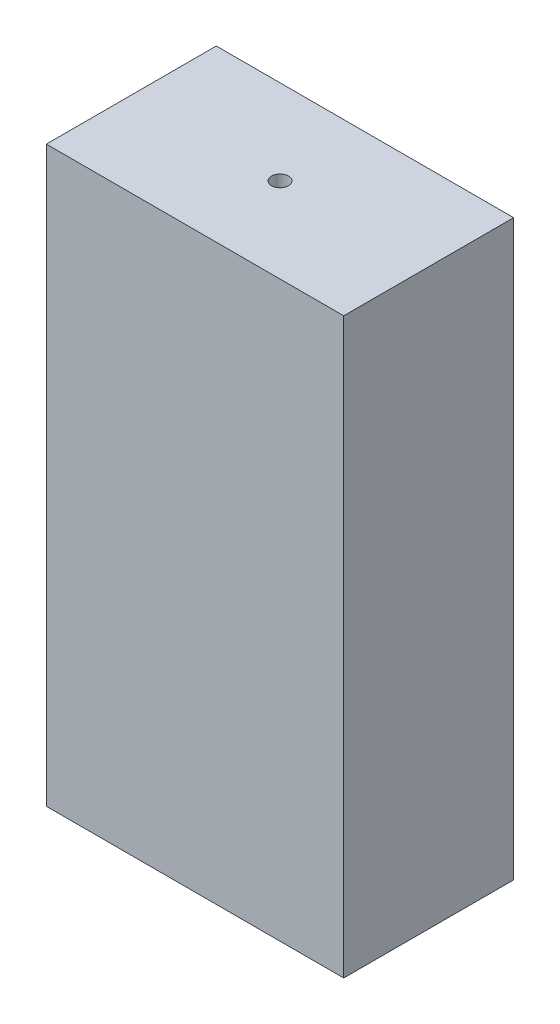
ISO-10303-21;
HEADER;
FILE_DESCRIPTION(('STEP AP214'),'2;1');
FILE_NAME('part.step','',(''),(''),'','','');
FILE_SCHEMA(('AUTOMOTIVE_DESIGN { 1 0 10303 214 1 1 1 1 }'));
ENDSEC;
DATA;
#1=APPLICATION_CONTEXT('core data for automotive mechanical design processes');
#2=APPLICATION_PROTOCOL_DEFINITION('international standard','automotive_design',2000,#1);
#3=PRODUCT_CONTEXT('',#1,'mechanical');
#4=PRODUCT('Part','Part','',(#3));
#5=PRODUCT_RELATED_PRODUCT_CATEGORY('part','',(#4));
#6=PRODUCT_DEFINITION_FORMATION('','',#4);
#7=PRODUCT_DEFINITION_CONTEXT('part definition',#1,'design');
#8=PRODUCT_DEFINITION('design','',#6,#7);
#9=PRODUCT_DEFINITION_SHAPE('','',#8);
#10=(LENGTH_UNIT() NAMED_UNIT(*) SI_UNIT(.MILLI.,.METRE.));
#11=(NAMED_UNIT(*) PLANE_ANGLE_UNIT() SI_UNIT($,.RADIAN.));
#12=(NAMED_UNIT(*) SI_UNIT($,.STERADIAN.) SOLID_ANGLE_UNIT());
#13=UNCERTAINTY_MEASURE_WITH_UNIT(LENGTH_MEASURE(1.E-05),#10,'distance_accuracy_value','');
#14=(GEOMETRIC_REPRESENTATION_CONTEXT(3) GLOBAL_UNCERTAINTY_ASSIGNED_CONTEXT((#13)) GLOBAL_UNIT_ASSIGNED_CONTEXT((#10,
#11,#12)) REPRESENTATION_CONTEXT('',''));
#15=CARTESIAN_POINT('',(0.,0.,0.));
#16=DIRECTION('',(0.,0.,1.));
#17=DIRECTION('',(1.,0.,0.));
#18=AXIS2_PLACEMENT_3D('',#15,#16,#17);
#19=CARTESIAN_POINT('',(44.45,171.45,-25.4));
#20=DIRECTION('',(-1.,0.,0.));
#21=DIRECTION('',(0.,0.,1.));
#22=AXIS2_PLACEMENT_3D('',#19,#20,#21);
#23=PLANE('',#22);
#24=DIRECTION('',(0.,0.,-1.));
#25=VECTOR('',#24,1.);
#26=CARTESIAN_POINT('',(44.45,0.,-25.4));
#27=LINE('',#26,#25);
#28=CARTESIAN_POINT('',(44.45,0.,25.4));
#29=VERTEX_POINT('',#28);
#30=CARTESIAN_POINT('',(44.45,0.,-25.4));
#31=VERTEX_POINT('',#30);
#32=EDGE_CURVE('E93',#29,#31,#27,.T.);
#33=ORIENTED_EDGE('',*,*,#32,.T.);
#34=DIRECTION('',(0.,-1.,0.));
#35=VECTOR('',#34,1.);
#36=CARTESIAN_POINT('',(44.45,171.45,-25.4));
#37=LINE('',#36,#35);
#38=CARTESIAN_POINT('',(44.45,171.45,-25.4));
#39=VERTEX_POINT('',#38);
#40=EDGE_CURVE('E11',#39,#31,#37,.T.);
#41=ORIENTED_EDGE('',*,*,#40,.F.);
#42=DIRECTION('',(0.,0.,-1.));
#43=VECTOR('',#42,1.);
#44=CARTESIAN_POINT('',(44.45,171.45,-25.4));
#45=LINE('',#44,#43);
#46=CARTESIAN_POINT('',(44.45,171.45,25.4));
#47=VERTEX_POINT('',#46);
#48=EDGE_CURVE('E102',#47,#39,#45,.T.);
#49=ORIENTED_EDGE('',*,*,#48,.F.);
#50=DIRECTION('',(0.,-1.,0.));
#51=VECTOR('',#50,1.);
#52=CARTESIAN_POINT('',(44.45,171.45,25.4));
#53=LINE('',#52,#51);
#54=EDGE_CURVE('E107',#47,#29,#53,.T.);
#55=ORIENTED_EDGE('',*,*,#54,.T.);
#56=EDGE_LOOP('',(#33,#41,#49,#55));
#57=FACE_BOUND('',#56,.T.);
#58=ADVANCED_FACE('F32',(#57),#23,.F.);
#59=CARTESIAN_POINT('',(-44.45,171.45,-25.4));
#60=DIRECTION('',(0.,0.,1.));
#61=DIRECTION('',(1.,0.,0.));
#62=AXIS2_PLACEMENT_3D('',#59,#60,#61);
#63=PLANE('',#62);
#64=DIRECTION('',(-1.,0.,0.));
#65=VECTOR('',#64,1.);
#66=CARTESIAN_POINT('',(-44.45,0.,-25.4));
#67=LINE('',#66,#65);
#68=CARTESIAN_POINT('',(-44.45,0.,-25.4));
#69=VERTEX_POINT('',#68);
#70=EDGE_CURVE('E97',#31,#69,#67,.T.);
#71=ORIENTED_EDGE('',*,*,#70,.T.);
#72=DIRECTION('',(0.,-1.,0.));
#73=VECTOR('',#72,1.);
#74=CARTESIAN_POINT('',(-44.45,171.45,-25.4));
#75=LINE('',#74,#73);
#76=CARTESIAN_POINT('',(-44.45,171.45,-25.4));
#77=VERTEX_POINT('',#76);
#78=EDGE_CURVE('E40',#77,#69,#75,.T.);
#79=ORIENTED_EDGE('',*,*,#78,.F.);
#80=DIRECTION('',(-1.,0.,0.));
#81=VECTOR('',#80,1.);
#82=CARTESIAN_POINT('',(-44.45,171.45,-25.4));
#83=LINE('',#82,#81);
#84=EDGE_CURVE('E79',#39,#77,#83,.T.);
#85=ORIENTED_EDGE('',*,*,#84,.F.);
#86=ORIENTED_EDGE('',*,*,#40,.T.);
#87=EDGE_LOOP('',(#71,#79,#85,#86));
#88=FACE_BOUND('',#87,.T.);
#89=ADVANCED_FACE('F131',(#88),#63,.F.);
#90=CARTESIAN_POINT('',(-44.45,171.45,-25.4));
#91=DIRECTION('',(1.,0.,0.));
#92=DIRECTION('',(0.,0.,-1.));
#93=AXIS2_PLACEMENT_3D('',#90,#91,#92);
#94=PLANE('',#93);
#95=DIRECTION('',(0.,0.,1.));
#96=VECTOR('',#95,1.);
#97=CARTESIAN_POINT('',(-44.45,0.,-25.4));
#98=LINE('',#97,#96);
#99=CARTESIAN_POINT('',(-44.45,0.,25.4));
#100=VERTEX_POINT('',#99);
#101=EDGE_CURVE('E66',#69,#100,#98,.T.);
#102=ORIENTED_EDGE('',*,*,#101,.T.);
#103=DIRECTION('',(0.,-1.,0.));
#104=VECTOR('',#103,1.);
#105=CARTESIAN_POINT('',(-44.45,171.45,25.4));
#106=LINE('',#105,#104);
#107=CARTESIAN_POINT('',(-44.45,171.45,25.4));
#108=VERTEX_POINT('',#107);
#109=EDGE_CURVE('E113',#108,#100,#106,.T.);
#110=ORIENTED_EDGE('',*,*,#109,.F.);
#111=DIRECTION('',(0.,0.,1.));
#112=VECTOR('',#111,1.);
#113=CARTESIAN_POINT('',(-44.45,171.45,-25.4));
#114=LINE('',#113,#112);
#115=EDGE_CURVE('E105',#77,#108,#114,.T.);
#116=ORIENTED_EDGE('',*,*,#115,.F.);
#117=ORIENTED_EDGE('',*,*,#78,.T.);
#118=EDGE_LOOP('',(#102,#110,#116,#117));
#119=FACE_BOUND('',#118,.T.);
#120=ADVANCED_FACE('F115',(#119),#94,.F.);
#121=CARTESIAN_POINT('',(-44.45,171.45,25.4));
#122=DIRECTION('',(0.,0.,-1.));
#123=DIRECTION('',(-1.,0.,0.));
#124=AXIS2_PLACEMENT_3D('',#121,#122,#123);
#125=PLANE('',#124);
#126=DIRECTION('',(1.,0.,0.));
#127=VECTOR('',#126,1.);
#128=CARTESIAN_POINT('',(-44.45,0.,25.4));
#129=LINE('',#128,#127);
#130=EDGE_CURVE('E72',#100,#29,#129,.T.);
#131=ORIENTED_EDGE('',*,*,#130,.T.);
#132=ORIENTED_EDGE('',*,*,#54,.F.);
#133=DIRECTION('',(1.,0.,0.));
#134=VECTOR('',#133,1.);
#135=CARTESIAN_POINT('',(-44.45,171.45,25.4));
#136=LINE('',#135,#134);
#137=EDGE_CURVE('E48',#108,#47,#136,.T.);
#138=ORIENTED_EDGE('',*,*,#137,.F.);
#139=ORIENTED_EDGE('',*,*,#109,.T.);
#140=EDGE_LOOP('',(#131,#132,#138,#139));
#141=FACE_BOUND('',#140,.T.);
#142=ADVANCED_FACE('F121',(#141),#125,.F.);
#143=CARTESIAN_POINT('',(0.,171.45,0.));
#144=DIRECTION('',(0.,1.,0.));
#145=DIRECTION('',(0.,0.,1.));
#146=AXIS2_PLACEMENT_3D('',#143,#144,#145);
#147=PLANE('',#146);
#148=CARTESIAN_POINT('',(0.,171.45,0.));
#149=DIRECTION('',(0.,1.,0.));
#150=DIRECTION('',(0.,0.,1.));
#151=AXIS2_PLACEMENT_3D('',#148,#149,#150);
#152=CIRCLE('',#151,2.52729999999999);
#153=CARTESIAN_POINT('',(0.,171.45,2.52729999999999));
#154=VERTEX_POINT('',#153);
#155=EDGE_CURVE('E94',#154,#154,#152,.T.);
#156=ORIENTED_EDGE('',*,*,#155,.F.);
#157=EDGE_LOOP('',(#156));
#158=FACE_BOUND('',#157,.T.);
#159=ORIENTED_EDGE('',*,*,#48,.T.);
#160=ORIENTED_EDGE('',*,*,#84,.T.);
#161=ORIENTED_EDGE('',*,*,#115,.T.);
#162=ORIENTED_EDGE('',*,*,#137,.T.);
#163=EDGE_LOOP('',(#159,#160,#161,#162));
#164=FACE_BOUND('',#163,.T.);
#165=ADVANCED_FACE('F123',(#158,#164),#147,.T.);
#166=CARTESIAN_POINT('',(0.,0.,0.));
#167=DIRECTION('',(0.,1.,0.));
#168=DIRECTION('',(0.,0.,1.));
#169=AXIS2_PLACEMENT_3D('',#166,#167,#168);
#170=PLANE('',#169);
#171=ORIENTED_EDGE('',*,*,#32,.F.);
#172=ORIENTED_EDGE('',*,*,#130,.F.);
#173=ORIENTED_EDGE('',*,*,#101,.F.);
#174=ORIENTED_EDGE('',*,*,#70,.F.);
#175=EDGE_LOOP('',(#171,#172,#173,#174));
#176=FACE_BOUND('',#175,.T.);
#177=ADVANCED_FACE('F87',(#176),#170,.F.);
#178=CARTESIAN_POINT('',(0.,146.05,0.));
#179=DIRECTION('',(0.,1.,0.));
#180=DIRECTION('',(0.,0.,1.));
#181=AXIS2_PLACEMENT_3D('',#178,#179,#180);
#182=CONICAL_SURFACE('',#181,2.52729999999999,1.02974425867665);
#183=CARTESIAN_POINT('',(0.,144.531444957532,0.));
#184=VERTEX_POINT('',#183);
#185=VERTEX_LOOP('',#184);
#186=FACE_BOUND('',#185,.T.);
#187=CARTESIAN_POINT('',(0.,146.05,0.));
#188=DIRECTION('',(0.,1.,0.));
#189=DIRECTION('',(0.,0.,1.));
#190=AXIS2_PLACEMENT_3D('',#187,#188,#189);
#191=CIRCLE('',#190,2.52729999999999);
#192=CARTESIAN_POINT('',(0.,146.05,2.52729999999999));
#193=VERTEX_POINT('',#192);
#194=EDGE_CURVE('E91',#193,#193,#191,.T.);
#195=ORIENTED_EDGE('',*,*,#194,.T.);
#196=EDGE_LOOP('',(#195));
#197=FACE_BOUND('',#196,.T.);
#198=ADVANCED_FACE('F83',(#186,#197),#182,.F.);
#199=CARTESIAN_POINT('',(0.,171.45,0.));
#200=DIRECTION('',(0.,1.,0.));
#201=DIRECTION('',(0.,0.,1.));
#202=AXIS2_PLACEMENT_3D('',#199,#200,#201);
#203=CYLINDRICAL_SURFACE('',#202,2.52729999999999);
#204=ORIENTED_EDGE('',*,*,#194,.F.);
#205=EDGE_LOOP('',(#204));
#206=FACE_BOUND('',#205,.T.);
#207=ORIENTED_EDGE('',*,*,#155,.T.);
#208=EDGE_LOOP('',(#207));
#209=FACE_BOUND('',#208,.T.);
#210=ADVANCED_FACE('F86',(#206,#209),#203,.F.);
#211=CLOSED_SHELL('',(#58,#89,#120,#142,#165,#177,#198,#210));
#212=MANIFOLD_SOLID_BREP('B2',#211);
#213=ADVANCED_BREP_SHAPE_REPRESENTATION('',(#18,#212),#14);
#214=SHAPE_DEFINITION_REPRESENTATION(#9,#213);
ENDSEC;
END-ISO-10303-21;
